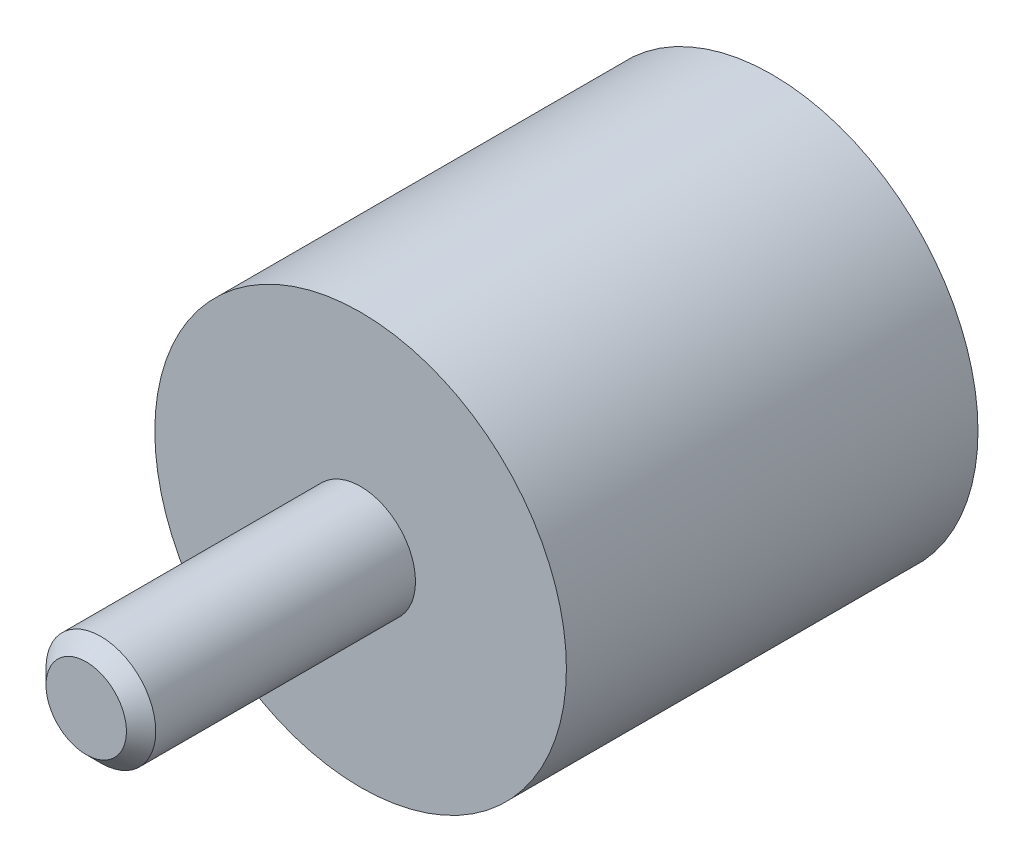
ISO-10303-21;
HEADER;
FILE_DESCRIPTION(('STEP AP214'),'2;1');
FILE_NAME('part.step','',(''),(''),'','','');
FILE_SCHEMA(('AUTOMOTIVE_DESIGN { 1 0 10303 214 1 1 1 1 }'));
ENDSEC;
DATA;
#1=APPLICATION_CONTEXT('core data for automotive mechanical design processes');
#2=APPLICATION_PROTOCOL_DEFINITION('international standard','automotive_design',2000,#1);
#3=PRODUCT_CONTEXT('',#1,'mechanical');
#4=PRODUCT('Part','Part','',(#3));
#5=PRODUCT_RELATED_PRODUCT_CATEGORY('part','',(#4));
#6=PRODUCT_DEFINITION_FORMATION('','',#4);
#7=PRODUCT_DEFINITION_CONTEXT('part definition',#1,'design');
#8=PRODUCT_DEFINITION('design','',#6,#7);
#9=PRODUCT_DEFINITION_SHAPE('','',#8);
#10=(LENGTH_UNIT() NAMED_UNIT(*) SI_UNIT(.MILLI.,.METRE.));
#11=(NAMED_UNIT(*) PLANE_ANGLE_UNIT() SI_UNIT($,.RADIAN.));
#12=(NAMED_UNIT(*) SI_UNIT($,.STERADIAN.) SOLID_ANGLE_UNIT());
#13=UNCERTAINTY_MEASURE_WITH_UNIT(LENGTH_MEASURE(1.E-05),#10,'distance_accuracy_value','');
#14=(GEOMETRIC_REPRESENTATION_CONTEXT(3) GLOBAL_UNCERTAINTY_ASSIGNED_CONTEXT((#13)) GLOBAL_UNIT_ASSIGNED_CONTEXT((#10,
#11,#12)) REPRESENTATION_CONTEXT('',''));
#15=CARTESIAN_POINT('',(0.,0.,0.));
#16=DIRECTION('',(0.,0.,1.));
#17=DIRECTION('',(1.,0.,0.));
#18=AXIS2_PLACEMENT_3D('',#15,#16,#17);
#19=CARTESIAN_POINT('',(0.,0.,0.33333333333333));
#20=DIRECTION('',(0.,0.,1.));
#21=DIRECTION('',(0.,-1.,0.));
#22=AXIS2_PLACEMENT_3D('',#19,#20,#21);
#23=CYLINDRICAL_SURFACE('',#22,7.5);
#24=CARTESIAN_POINT('',(0.,0.,0.));
#25=DIRECTION('',(0.,0.,1.));
#26=DIRECTION('',(0.,-1.,0.));
#27=AXIS2_PLACEMENT_3D('',#24,#25,#26);
#28=CIRCLE('',#27,7.5);
#29=CARTESIAN_POINT('',(0.,-7.5,0.));
#30=VERTEX_POINT('',#29);
#31=EDGE_CURVE('E27',#30,#30,#28,.T.);
#32=ORIENTED_EDGE('',*,*,#31,.T.);
#33=EDGE_LOOP('',(#32));
#34=FACE_BOUND('',#33,.T.);
#35=CARTESIAN_POINT('',(0.,0.,15.));
#36=DIRECTION('',(0.,0.,-1.));
#37=DIRECTION('',(-1.,0.,0.));
#38=AXIS2_PLACEMENT_3D('',#35,#36,#37);
#39=CIRCLE('',#38,7.5);
#40=CARTESIAN_POINT('',(-7.5,0.,15.));
#41=VERTEX_POINT('',#40);
#42=EDGE_CURVE('E35',#41,#41,#39,.T.);
#43=ORIENTED_EDGE('',*,*,#42,.T.);
#44=EDGE_LOOP('',(#43));
#45=FACE_BOUND('',#44,.T.);
#46=ADVANCED_FACE('F12',(#34,#45),#23,.T.);
#47=CARTESIAN_POINT('',(7.5,0.,0.));
#48=DIRECTION('',(0.,0.,-1.));
#49=DIRECTION('',(0.,1.,0.));
#50=AXIS2_PLACEMENT_3D('',#47,#48,#49);
#51=PLANE('',#50);
#52=CARTESIAN_POINT('',(0.,0.,0.));
#53=DIRECTION('',(0.,0.,-1.));
#54=DIRECTION('',(0.,1.,0.));
#55=AXIS2_PLACEMENT_3D('',#52,#53,#54);
#56=CIRCLE('',#55,2.4);
#57=CARTESIAN_POINT('',(0.,2.4,0.));
#58=VERTEX_POINT('',#57);
#59=EDGE_CURVE('E19',#58,#58,#56,.F.);
#60=ORIENTED_EDGE('',*,*,#59,.T.);
#61=EDGE_LOOP('',(#60));
#62=FACE_BOUND('',#61,.T.);
#63=ORIENTED_EDGE('',*,*,#31,.F.);
#64=EDGE_LOOP('',(#63));
#65=FACE_BOUND('',#64,.T.);
#66=ADVANCED_FACE('F58',(#62,#65),#51,.T.);
#67=CARTESIAN_POINT('',(0.,0.,0.));
#68=DIRECTION('',(0.,0.,1.));
#69=DIRECTION('',(0.,-1.,0.));
#70=AXIS2_PLACEMENT_3D('',#67,#68,#69);
#71=CYLINDRICAL_SURFACE('',#70,2.);
#72=CARTESIAN_POINT('',(0.,0.,0.399999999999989));
#73=DIRECTION('',(0.,0.,-1.));
#74=DIRECTION('',(0.,1.,0.));
#75=AXIS2_PLACEMENT_3D('',#72,#73,#74);
#76=CIRCLE('',#75,2.);
#77=CARTESIAN_POINT('',(0.,2.,0.399999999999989));
#78=VERTEX_POINT('',#77);
#79=EDGE_CURVE('E23',#78,#78,#76,.T.);
#80=ORIENTED_EDGE('',*,*,#79,.T.);
#81=EDGE_LOOP('',(#80));
#82=FACE_BOUND('',#81,.T.);
#83=CARTESIAN_POINT('',(0.,0.,4.));
#84=DIRECTION('',(0.,0.,-1.));
#85=DIRECTION('',(0.,1.,0.));
#86=AXIS2_PLACEMENT_3D('',#83,#84,#85);
#87=CIRCLE('',#86,2.);
#88=CARTESIAN_POINT('',(0.,2.,4.));
#89=VERTEX_POINT('',#88);
#90=EDGE_CURVE('E32',#89,#89,#87,.T.);
#91=ORIENTED_EDGE('',*,*,#90,.F.);
#92=EDGE_LOOP('',(#91));
#93=FACE_BOUND('',#92,.T.);
#94=ADVANCED_FACE('F63',(#82,#93),#71,.F.);
#95=CARTESIAN_POINT('',(0.,0.,4.));
#96=DIRECTION('',(0.,0.,-1.));
#97=DIRECTION('',(0.,1.,0.));
#98=AXIS2_PLACEMENT_3D('',#95,#96,#97);
#99=PLANE('',#98);
#100=ORIENTED_EDGE('',*,*,#90,.T.);
#101=EDGE_LOOP('',(#100));
#102=FACE_BOUND('',#101,.T.);
#103=ADVANCED_FACE('F69',(#102),#99,.T.);
#104=CARTESIAN_POINT('',(0.,0.,0.399999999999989));
#105=DIRECTION('',(0.,0.,-1.));
#106=DIRECTION('',(0.,1.,0.));
#107=AXIS2_PLACEMENT_3D('',#104,#105,#106);
#108=CONICAL_SURFACE('',#107,2.,0.785398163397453);
#109=ORIENTED_EDGE('',*,*,#59,.F.);
#110=EDGE_LOOP('',(#109));
#111=FACE_BOUND('',#110,.T.);
#112=ORIENTED_EDGE('',*,*,#79,.F.);
#113=EDGE_LOOP('',(#112));
#114=FACE_BOUND('',#113,.T.);
#115=ADVANCED_FACE('F14',(#111,#114),#108,.F.);
#116=CARTESIAN_POINT('',(0.,7.5,15.));
#117=DIRECTION('',(0.,0.,1.));
#118=DIRECTION('',(1.,0.,0.));
#119=AXIS2_PLACEMENT_3D('',#116,#117,#118);
#120=PLANE('',#119);
#121=CARTESIAN_POINT('',(0.,0.,15.));
#122=DIRECTION('',(0.,0.,1.));
#123=DIRECTION('',(1.,0.,0.));
#124=AXIS2_PLACEMENT_3D('',#121,#122,#123);
#125=CIRCLE('',#124,2.);
#126=CARTESIAN_POINT('',(2.,0.,15.));
#127=VERTEX_POINT('',#126);
#128=EDGE_CURVE('E8',#127,#127,#125,.F.);
#129=ORIENTED_EDGE('',*,*,#128,.T.);
#130=EDGE_LOOP('',(#129));
#131=FACE_BOUND('',#130,.T.);
#132=ORIENTED_EDGE('',*,*,#42,.F.);
#133=EDGE_LOOP('',(#132));
#134=FACE_BOUND('',#133,.T.);
#135=ADVANCED_FACE('F73',(#131,#134),#120,.T.);
#136=CARTESIAN_POINT('',(0.,0.,10.));
#137=DIRECTION('',(0.,0.,1.));
#138=DIRECTION('',(0.,-1.,0.));
#139=AXIS2_PLACEMENT_3D('',#136,#137,#138);
#140=CYLINDRICAL_SURFACE('',#139,2.);
#141=ORIENTED_EDGE('',*,*,#128,.F.);
#142=EDGE_LOOP('',(#141));
#143=FACE_BOUND('',#142,.T.);
#144=CARTESIAN_POINT('',(0.,0.,24.4654758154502));
#145=DIRECTION('',(0.,0.,-1.));
#146=DIRECTION('',(-1.,0.,0.));
#147=AXIS2_PLACEMENT_3D('',#144,#145,#146);
#148=CIRCLE('',#147,2.);
#149=CARTESIAN_POINT('',(-2.,0.,24.4654758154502));
#150=VERTEX_POINT('',#149);
#151=EDGE_CURVE('E38',#150,#150,#148,.T.);
#152=ORIENTED_EDGE('',*,*,#151,.T.);
#153=EDGE_LOOP('',(#152));
#154=FACE_BOUND('',#153,.T.);
#155=ADVANCED_FACE('F55',(#143,#154),#140,.T.);
#156=CARTESIAN_POINT('',(0.,0.,24.4654758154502));
#157=DIRECTION('',(0.,0.,-1.));
#158=DIRECTION('',(-1.,0.,0.));
#159=AXIS2_PLACEMENT_3D('',#156,#157,#158);
#160=CONICAL_SURFACE('',#159,2.,0.785398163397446);
#161=CARTESIAN_POINT('',(0.,0.,25.));
#162=DIRECTION('',(0.,0.,-1.));
#163=DIRECTION('',(-1.,0.,0.));
#164=AXIS2_PLACEMENT_3D('',#161,#162,#163);
#165=CIRCLE('',#164,1.46547581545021);
#166=CARTESIAN_POINT('',(-1.46547581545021,0.,25.));
#167=VERTEX_POINT('',#166);
#168=EDGE_CURVE('E41',#167,#167,#165,.T.);
#169=ORIENTED_EDGE('',*,*,#168,.T.);
#170=EDGE_LOOP('',(#169));
#171=FACE_BOUND('',#170,.T.);
#172=ORIENTED_EDGE('',*,*,#151,.F.);
#173=EDGE_LOOP('',(#172));
#174=FACE_BOUND('',#173,.T.);
#175=ADVANCED_FACE('F45',(#171,#174),#160,.T.);
#176=CARTESIAN_POINT('',(0.,1.46547581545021,25.));
#177=DIRECTION('',(0.,0.,1.));
#178=DIRECTION('',(1.,0.,0.));
#179=AXIS2_PLACEMENT_3D('',#176,#177,#178);
#180=PLANE('',#179);
#181=ORIENTED_EDGE('',*,*,#168,.F.);
#182=EDGE_LOOP('',(#181));
#183=FACE_BOUND('',#182,.T.);
#184=ADVANCED_FACE('F48',(#183),#180,.T.);
#185=CLOSED_SHELL('',(#46,#66,#94,#103,#115,#135,#155,#175,#184));
#186=MANIFOLD_SOLID_BREP('B1',#185);
#187=ADVANCED_BREP_SHAPE_REPRESENTATION('',(#18,#186),#14);
#188=SHAPE_DEFINITION_REPRESENTATION(#9,#187);
ENDSEC;
END-ISO-10303-21;
